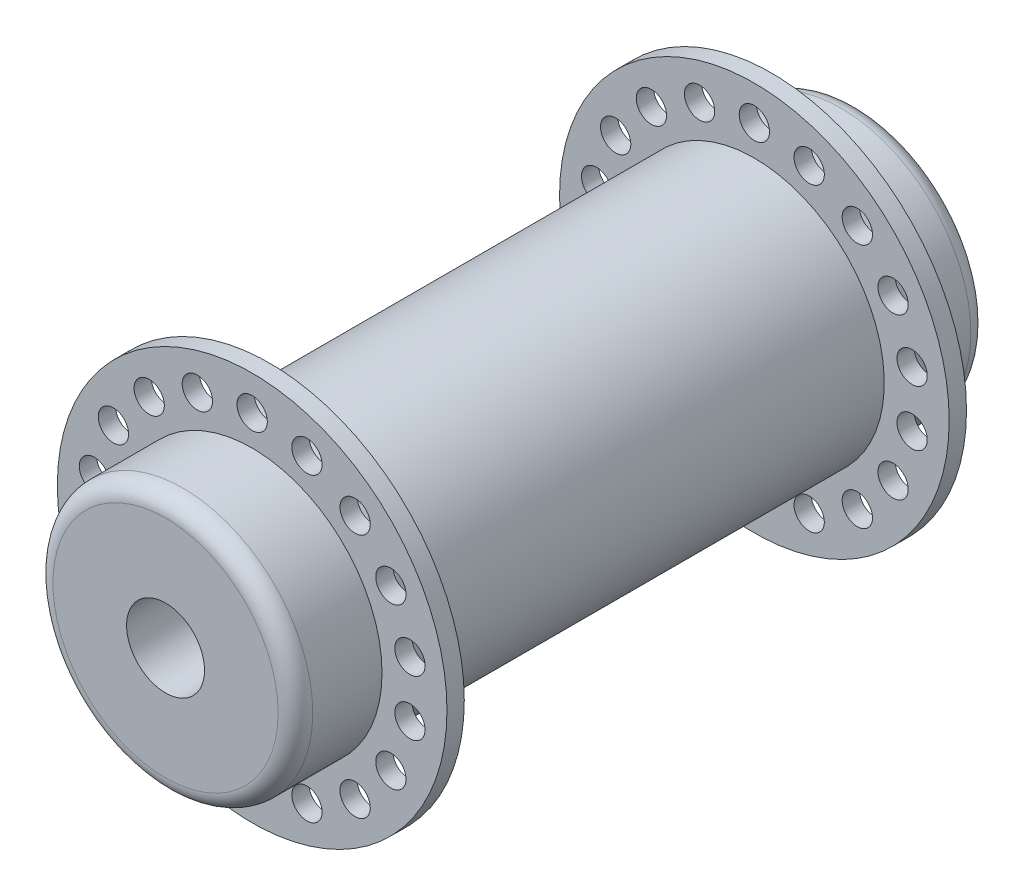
from build123d import *

# Parameters (mm, degrees)
BOSS_EXTRUDE1_DEPTH      = 40
BOSS_EXTRUDE1_DEPTH_BACK = 40
SKETCH1_R                = 15
SKETCH1_R_2              = 4.5
SKETCH4_R                = 22.5
SKETCH4_R_2              = 15
BOSS_EXTRUDE3_DEPTH      = 2
FILLET2_R                = 2
CUT_EXTRUDE1_DEPTH       = 77.892782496
CUT_EXTRUDE1_DEPTH_BACK  = 77.892782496
SKETCH5_R                = 1.75


with BuildPart() as part:
    # Sketch1 → Boss-Extrude1 (new, two sides: drawn at the far end of the back side and taken through both)
    with BuildSketch(Plane.XY.offset(-BOSS_EXTRUDE1_DEPTH_BACK)):
        Circle(SKETCH1_R)
        Circle(SKETCH1_R_2, mode=Mode.SUBTRACT)
    extrude(amount=BOSS_EXTRUDE1_DEPTH + BOSS_EXTRUDE1_DEPTH_BACK)

    # Sketch4 → Boss-Extrude3 (add)
    with BuildSketch(Plane(origin=(0, 0, -28), x_dir=(-1, 0, 0), z_dir=(0, 0, -1))):
        Circle(SKETCH4_R)
        with Locations(Location((0, 0, 0), (0, 0, 180))):
            Circle(SKETCH4_R_2, mode=Mode.SUBTRACT)
    boss_extrude3 = extrude(amount=BOSS_EXTRUDE3_DEPTH)

    # Fillet2
    fillet2_edges = [part.edges().sort_by_distance(p)[0] for p in [
        (-15, 0, -40),
        (-15, 0, 40),
    ]]
    fillet(fillet2_edges, radius=FILLET2_R)

    # Mirror2: Boss-Extrude3 across plane
    add(boss_extrude3.mirror(Plane.XY))

    # Sketch5 → Cut-Extrude1 (cut, two sides: drawn at the far end of the back side and taken through both)
    with BuildSketch(Plane(origin=(0, 0, -30), x_dir=(-1, 0, 0), z_dir=(0, 0, -1)).offset(-CUT_EXTRUDE1_DEPTH_BACK)):
        with Locations(Location((0, -18.5, 0), (0, 0, 180))):
            Circle(SKETCH5_R)
        with Locations(Location((-6.327372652, -17.384313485, 0), (0, 0, 180))):
            Circle(SKETCH5_R)
        with Locations(Location((-11.891570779, -14.171822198, 0), (0, 0, 180))):
            Circle(SKETCH5_R)
        with Locations(Location((-16.02146997, -9.25, 0), (0, 0, 180))):
            Circle(SKETCH5_R)
        with Locations(Location((-18.218943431, -3.212491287, 0), (0, 0, 180))):
            Circle(SKETCH5_R)
        with Locations(Location((-18.218943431, 3.212491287, 0), (0, 0, 180))):
            Circle(SKETCH5_R)
        with Locations(Location((-16.02146997, 9.25, 0), (0, 0, 180))):
            Circle(SKETCH5_R)
        with Locations(Location((-11.891570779, 14.171822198, 0), (0, 0, 180))):
            Circle(SKETCH5_R)
        with Locations(Location((-6.327372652, 17.384313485, 0), (0, 0, 180))):
            Circle(SKETCH5_R)
        with Locations(Location((0, 18.5, 0), (0, 0, 180))):
            Circle(SKETCH5_R)
        with Locations(Location((6.327372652, 17.384313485, 0), (0, 0, 180))):
            Circle(SKETCH5_R)
        with Locations(Location((11.891570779, 14.171822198, 0), (0, 0, 180))):
            Circle(SKETCH5_R)
        with Locations(Location((16.02146997, 9.25, 0), (0, 0, 180))):
            Circle(SKETCH5_R)
        with Locations(Location((18.218943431, 3.212491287, 0), (0, 0, 180))):
            Circle(SKETCH5_R)
        with Locations(Location((18.218943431, -3.212491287, 0), (0, 0, 180))):
            Circle(SKETCH5_R)
        with Locations(Location((16.02146997, -9.25, 0), (0, 0, 180))):
            Circle(SKETCH5_R)
        with Locations(Location((11.891570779, -14.171822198, 0), (0, 0, 180))):
            Circle(SKETCH5_R)
        with Locations(Location((6.327372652, -17.384313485, 0), (0, 0, 180))):
            Circle(SKETCH5_R)
    extrude(amount=CUT_EXTRUDE1_DEPTH + CUT_EXTRUDE1_DEPTH_BACK, mode=Mode.SUBTRACT)


solid = part.part
